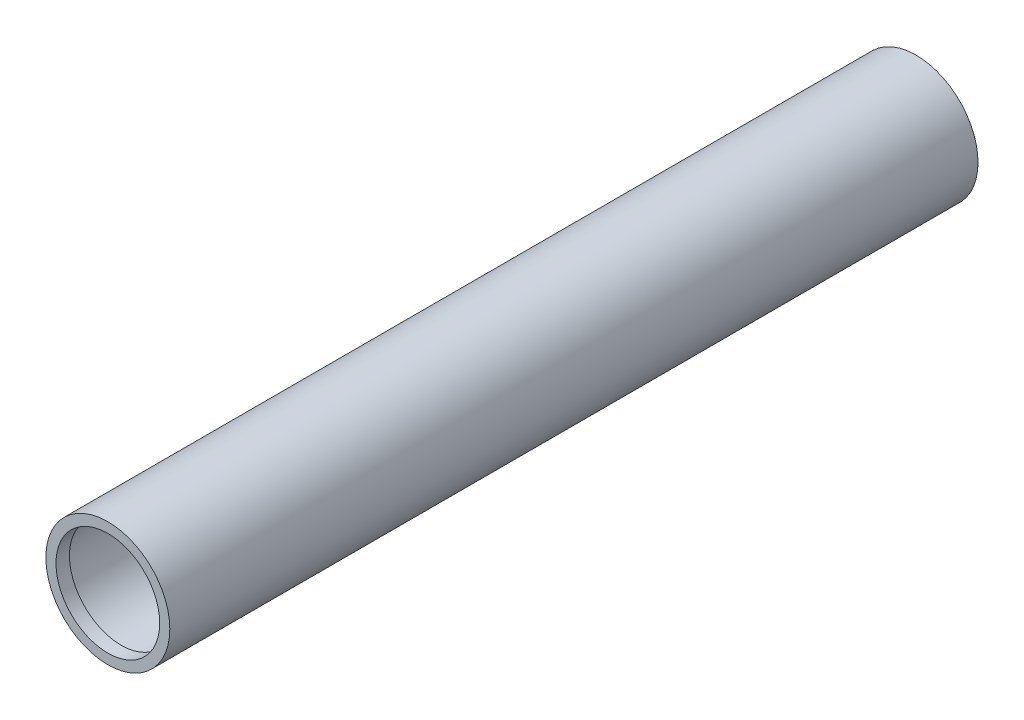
ISO-10303-21;
HEADER;
FILE_DESCRIPTION(('STEP AP214'),'2;1');
FILE_NAME('part.step','',(''),(''),'','','');
FILE_SCHEMA(('AUTOMOTIVE_DESIGN { 1 0 10303 214 1 1 1 1 }'));
ENDSEC;
DATA;
#1=APPLICATION_CONTEXT('core data for automotive mechanical design processes');
#2=APPLICATION_PROTOCOL_DEFINITION('international standard','automotive_design',2000,#1);
#3=PRODUCT_CONTEXT('',#1,'mechanical');
#4=PRODUCT('Part','Part','',(#3));
#5=PRODUCT_RELATED_PRODUCT_CATEGORY('part','',(#4));
#6=PRODUCT_DEFINITION_FORMATION('','',#4);
#7=PRODUCT_DEFINITION_CONTEXT('part definition',#1,'design');
#8=PRODUCT_DEFINITION('design','',#6,#7);
#9=PRODUCT_DEFINITION_SHAPE('','',#8);
#10=(LENGTH_UNIT() NAMED_UNIT(*) SI_UNIT(.MILLI.,.METRE.));
#11=(NAMED_UNIT(*) PLANE_ANGLE_UNIT() SI_UNIT($,.RADIAN.));
#12=(NAMED_UNIT(*) SI_UNIT($,.STERADIAN.) SOLID_ANGLE_UNIT());
#13=UNCERTAINTY_MEASURE_WITH_UNIT(LENGTH_MEASURE(1.E-05),#10,'distance_accuracy_value','');
#14=(GEOMETRIC_REPRESENTATION_CONTEXT(3) GLOBAL_UNCERTAINTY_ASSIGNED_CONTEXT((#13)) GLOBAL_UNIT_ASSIGNED_CONTEXT((#10,
#11,#12)) REPRESENTATION_CONTEXT('',''));
#15=CARTESIAN_POINT('',(0.,0.,0.));
#16=DIRECTION('',(0.,0.,1.));
#17=DIRECTION('',(1.,0.,0.));
#18=AXIS2_PLACEMENT_3D('',#15,#16,#17);
#19=CARTESIAN_POINT('',(0.,0.,300.));
#20=DIRECTION('',(0.,0.,-1.));
#21=DIRECTION('',(-1.,0.,0.));
#22=AXIS2_PLACEMENT_3D('',#19,#20,#21);
#23=CYLINDRICAL_SURFACE('',#22,23.);
#24=CARTESIAN_POINT('',(0.,0.,300.));
#25=DIRECTION('',(0.,0.,1.));
#26=DIRECTION('',(1.,0.,0.));
#27=AXIS2_PLACEMENT_3D('',#24,#25,#26);
#28=CIRCLE('',#27,23.);
#29=CARTESIAN_POINT('',(23.,0.,300.));
#30=VERTEX_POINT('',#29);
#31=EDGE_CURVE('E12',#30,#30,#28,.T.);
#32=ORIENTED_EDGE('',*,*,#31,.F.);
#33=EDGE_LOOP('',(#32));
#34=FACE_BOUND('',#33,.T.);
#35=CARTESIAN_POINT('',(0.,0.,0.));
#36=DIRECTION('',(0.,0.,1.));
#37=DIRECTION('',(1.,0.,0.));
#38=AXIS2_PLACEMENT_3D('',#35,#36,#37);
#39=CIRCLE('',#38,23.);
#40=CARTESIAN_POINT('',(23.,0.,0.));
#41=VERTEX_POINT('',#40);
#42=EDGE_CURVE('E53',#41,#41,#39,.T.);
#43=ORIENTED_EDGE('',*,*,#42,.T.);
#44=EDGE_LOOP('',(#43));
#45=FACE_BOUND('',#44,.T.);
#46=ADVANCED_FACE('F46',(#34,#45),#23,.T.);
#47=CARTESIAN_POINT('',(0.,0.,300.));
#48=DIRECTION('',(0.,0.,1.));
#49=DIRECTION('',(1.,0.,0.));
#50=AXIS2_PLACEMENT_3D('',#47,#48,#49);
#51=PLANE('',#50);
#52=CARTESIAN_POINT('',(0.,0.,300.));
#53=DIRECTION('',(0.,0.,1.));
#54=DIRECTION('',(1.,0.,0.));
#55=AXIS2_PLACEMENT_3D('',#52,#53,#54);
#56=CIRCLE('',#55,19.25);
#57=CARTESIAN_POINT('',(19.25,0.,300.));
#58=VERTEX_POINT('',#57);
#59=EDGE_CURVE('E65',#58,#58,#56,.T.);
#60=ORIENTED_EDGE('',*,*,#59,.F.);
#61=EDGE_LOOP('',(#60));
#62=FACE_BOUND('',#61,.T.);
#63=ORIENTED_EDGE('',*,*,#31,.T.);
#64=EDGE_LOOP('',(#63));
#65=FACE_BOUND('',#64,.T.);
#66=ADVANCED_FACE('F89',(#62,#65),#51,.T.);
#67=CARTESIAN_POINT('',(0.,0.,0.));
#68=DIRECTION('',(0.,0.,1.));
#69=DIRECTION('',(1.,0.,0.));
#70=AXIS2_PLACEMENT_3D('',#67,#68,#69);
#71=PLANE('',#70);
#72=CARTESIAN_POINT('',(0.,0.,0.));
#73=DIRECTION('',(0.,0.,-1.));
#74=DIRECTION('',(-1.,0.,0.));
#75=AXIS2_PLACEMENT_3D('',#72,#73,#74);
#76=CIRCLE('',#75,20.75);
#77=CARTESIAN_POINT('',(-20.75,0.,0.));
#78=VERTEX_POINT('',#77);
#79=EDGE_CURVE('E60',#78,#78,#76,.T.);
#80=ORIENTED_EDGE('',*,*,#79,.F.);
#81=EDGE_LOOP('',(#80));
#82=FACE_BOUND('',#81,.T.);
#83=ORIENTED_EDGE('',*,*,#42,.F.);
#84=EDGE_LOOP('',(#83));
#85=FACE_BOUND('',#84,.T.);
#86=ADVANCED_FACE('F83',(#82,#85),#71,.F.);
#87=CARTESIAN_POINT('',(0.,0.,295.));
#88=DIRECTION('',(0.,0.,-1.));
#89=DIRECTION('',(-1.,0.,0.));
#90=AXIS2_PLACEMENT_3D('',#87,#88,#89);
#91=CYLINDRICAL_SURFACE('',#90,20.75);
#92=CARTESIAN_POINT('',(0.,0.,295.));
#93=DIRECTION('',(0.,0.,-1.));
#94=DIRECTION('',(-1.,0.,0.));
#95=AXIS2_PLACEMENT_3D('',#92,#93,#94);
#96=CIRCLE('',#95,20.75);
#97=CARTESIAN_POINT('',(-20.75,0.,295.));
#98=VERTEX_POINT('',#97);
#99=EDGE_CURVE('E58',#98,#98,#96,.T.);
#100=ORIENTED_EDGE('',*,*,#99,.F.);
#101=EDGE_LOOP('',(#100));
#102=FACE_BOUND('',#101,.T.);
#103=ORIENTED_EDGE('',*,*,#79,.T.);
#104=EDGE_LOOP('',(#103));
#105=FACE_BOUND('',#104,.T.);
#106=ADVANCED_FACE('F77',(#102,#105),#91,.F.);
#107=CARTESIAN_POINT('',(0.,0.,295.));
#108=DIRECTION('',(0.,0.,-1.));
#109=DIRECTION('',(-1.,0.,0.));
#110=AXIS2_PLACEMENT_3D('',#107,#108,#109);
#111=PLANE('',#110);
#112=CARTESIAN_POINT('',(0.,0.,295.));
#113=DIRECTION('',(0.,0.,-1.));
#114=DIRECTION('',(-1.,0.,0.));
#115=AXIS2_PLACEMENT_3D('',#112,#113,#114);
#116=CIRCLE('',#115,19.25);
#117=CARTESIAN_POINT('',(-19.25,0.,295.));
#118=VERTEX_POINT('',#117);
#119=EDGE_CURVE('E49',#118,#118,#116,.T.);
#120=ORIENTED_EDGE('',*,*,#119,.F.);
#121=EDGE_LOOP('',(#120));
#122=FACE_BOUND('',#121,.T.);
#123=ORIENTED_EDGE('',*,*,#99,.T.);
#124=EDGE_LOOP('',(#123));
#125=FACE_BOUND('',#124,.T.);
#126=ADVANCED_FACE('F74',(#122,#125),#111,.T.);
#127=CARTESIAN_POINT('',(0.,0.,5.));
#128=DIRECTION('',(0.,0.,1.));
#129=DIRECTION('',(1.,0.,0.));
#130=AXIS2_PLACEMENT_3D('',#127,#128,#129);
#131=CYLINDRICAL_SURFACE('',#130,19.25);
#132=ORIENTED_EDGE('',*,*,#119,.T.);
#133=EDGE_LOOP('',(#132));
#134=FACE_BOUND('',#133,.T.);
#135=ORIENTED_EDGE('',*,*,#59,.T.);
#136=EDGE_LOOP('',(#135));
#137=FACE_BOUND('',#136,.T.);
#138=ADVANCED_FACE('F72',(#134,#137),#131,.F.);
#139=CLOSED_SHELL('',(#46,#66,#86,#106,#126,#138));
#140=MANIFOLD_SOLID_BREP('B2',#139);
#141=ADVANCED_BREP_SHAPE_REPRESENTATION('',(#18,#140),#14);
#142=SHAPE_DEFINITION_REPRESENTATION(#9,#141);
ENDSEC;
END-ISO-10303-21;
